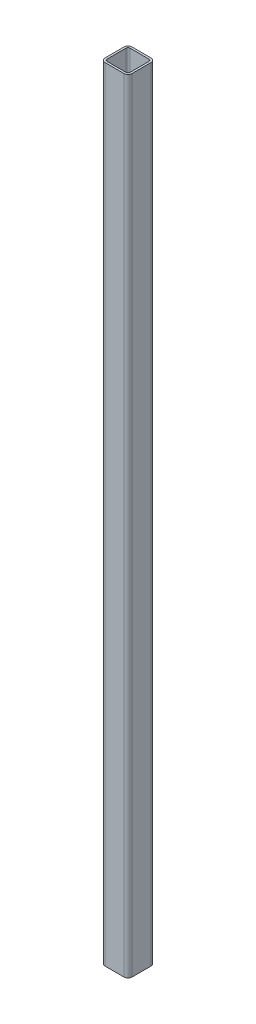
from build123d import *

# Parameters (mm, degrees)
EXTRU_MINCE1_DEPTH = 289.5


with BuildPart() as part:
    # Esquisse1 → Extru.-Mince1 (new, symmetric)
    with BuildSketch(Plane(origin=(0, 0, 0), x_dir=(1, 0, 0), z_dir=(0, 1, 0))):
        with BuildLine():
            Line((-7, -10), (7, -10))
            ThreePointArc((7, -10), (9.121320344, -9.121320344), (10, -7))
            Line((10, -7), (10, 7))
            ThreePointArc((10, 7), (9.121320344, 9.121320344), (7, 10))
            Line((7, 10), (-7, 10))
            ThreePointArc((-7, 10), (-9.121320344, 9.121320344), (-10, 7))
            Line((-10, 7), (-10, -7))
            ThreePointArc((-10, -7), (-9.121320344, -9.121320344), (-7, -10))
        make_face()
        with BuildLine():
            Line((-7, -8.5), (7, -8.5))
            ThreePointArc((7, -8.5), (8.060660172, -8.060660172), (8.5, -7))
            Line((8.5, -7), (8.5, 7))
            ThreePointArc((8.5, 7), (8.060660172, 8.060660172), (7, 8.5))
            Line((7, 8.5), (-7, 8.5))
            ThreePointArc((-7, 8.5), (-8.060660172, 8.060660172), (-8.5, 7))
            Line((-8.5, 7), (-8.5, -7))
            ThreePointArc((-8.5, -7), (-8.060660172, -8.060660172), (-7, -8.5))
        make_face(mode=Mode.SUBTRACT)
    extrude(amount=EXTRU_MINCE1_DEPTH, both=True)


solid = part.part
